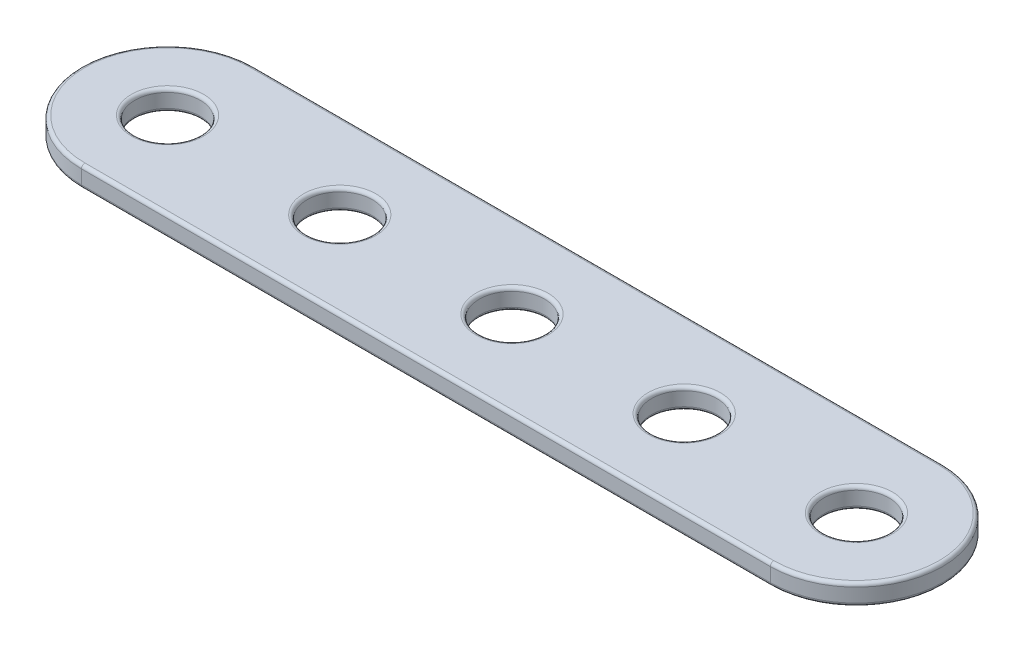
ISO-10303-21;
HEADER;
FILE_DESCRIPTION(('STEP AP214'),'2;1');
FILE_NAME('part.step','',(''),(''),'','','');
FILE_SCHEMA(('AUTOMOTIVE_DESIGN { 1 0 10303 214 1 1 1 1 }'));
ENDSEC;
DATA;
#1=APPLICATION_CONTEXT('core data for automotive mechanical design processes');
#2=APPLICATION_PROTOCOL_DEFINITION('international standard','automotive_design',2000,#1);
#3=PRODUCT_CONTEXT('',#1,'mechanical');
#4=PRODUCT('Part','Part','',(#3));
#5=PRODUCT_RELATED_PRODUCT_CATEGORY('part','',(#4));
#6=PRODUCT_DEFINITION_FORMATION('','',#4);
#7=PRODUCT_DEFINITION_CONTEXT('part definition',#1,'design');
#8=PRODUCT_DEFINITION('design','',#6,#7);
#9=PRODUCT_DEFINITION_SHAPE('','',#8);
#10=(LENGTH_UNIT() NAMED_UNIT(*) SI_UNIT(.MILLI.,.METRE.));
#11=(NAMED_UNIT(*) PLANE_ANGLE_UNIT() SI_UNIT($,.RADIAN.));
#12=(NAMED_UNIT(*) SI_UNIT($,.STERADIAN.) SOLID_ANGLE_UNIT());
#13=UNCERTAINTY_MEASURE_WITH_UNIT(LENGTH_MEASURE(1.E-05),#10,'distance_accuracy_value','');
#14=(GEOMETRIC_REPRESENTATION_CONTEXT(3) GLOBAL_UNCERTAINTY_ASSIGNED_CONTEXT((#13)) GLOBAL_UNIT_ASSIGNED_CONTEXT((#10,
#11,#12)) REPRESENTATION_CONTEXT('',''));
#15=CARTESIAN_POINT('',(0.,0.,0.));
#16=DIRECTION('',(0.,0.,1.));
#17=DIRECTION('',(1.,0.,0.));
#18=AXIS2_PLACEMENT_3D('',#15,#16,#17);
#19=CARTESIAN_POINT('',(0.,1.524,-6.35));
#20=DIRECTION('',(0.,-1.,0.));
#21=DIRECTION('',(0.,0.,-1.));
#22=AXIS2_PLACEMENT_3D('',#19,#20,#21);
#23=CYLINDRICAL_SURFACE('',#22,6.35);
#24=DIRECTION('',(0.,-1.,0.));
#25=VECTOR('',#24,1.);
#26=CARTESIAN_POINT('',(0.,1.524,-12.7));
#27=LINE('',#26,#25);
#28=CARTESIAN_POINT('',(0.,1.27,-12.7));
#29=VERTEX_POINT('',#28);
#30=CARTESIAN_POINT('',(0.,0.254000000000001,-12.7));
#31=VERTEX_POINT('',#30);
#32=EDGE_CURVE('E136',#29,#31,#27,.T.);
#33=ORIENTED_EDGE('',*,*,#32,.T.);
#34=CARTESIAN_POINT('',(0.,0.254,-6.35));
#35=DIRECTION('',(0.,1.,0.));
#36=DIRECTION('',(0.,0.,1.));
#37=AXIS2_PLACEMENT_3D('',#34,#35,#36);
#38=CIRCLE('',#37,6.35);
#39=CARTESIAN_POINT('',(0.,0.254000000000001,0.));
#40=VERTEX_POINT('',#39);
#41=EDGE_CURVE('E172',#31,#40,#38,.T.);
#42=ORIENTED_EDGE('',*,*,#41,.T.);
#43=DIRECTION('',(0.,-1.,0.));
#44=VECTOR('',#43,1.);
#45=CARTESIAN_POINT('',(0.,1.524,0.));
#46=LINE('',#45,#44);
#47=CARTESIAN_POINT('',(0.,1.27,0.));
#48=VERTEX_POINT('',#47);
#49=EDGE_CURVE('E110',#48,#40,#46,.T.);
#50=ORIENTED_EDGE('',*,*,#49,.F.);
#51=CARTESIAN_POINT('',(0.,1.27,-6.35));
#52=DIRECTION('',(0.,1.,0.));
#53=DIRECTION('',(0.,0.,1.));
#54=AXIS2_PLACEMENT_3D('',#51,#52,#53);
#55=CIRCLE('',#54,6.35);
#56=EDGE_CURVE('E170',#48,#29,#55,.F.);
#57=ORIENTED_EDGE('',*,*,#56,.T.);
#58=EDGE_LOOP('',(#33,#42,#50,#57));
#59=FACE_BOUND('',#58,.T.);
#60=ADVANCED_FACE('F26',(#59),#23,.T.);
#61=CARTESIAN_POINT('',(0.,1.524,0.));
#62=DIRECTION('',(0.,0.,-1.));
#63=DIRECTION('',(-1.,0.,0.));
#64=AXIS2_PLACEMENT_3D('',#61,#62,#63);
#65=PLANE('',#64);
#66=ORIENTED_EDGE('',*,*,#49,.T.);
#67=DIRECTION('',(1.,0.,0.));
#68=VECTOR('',#67,1.);
#69=CARTESIAN_POINT('',(0.,0.254,0.));
#70=LINE('',#69,#68);
#71=CARTESIAN_POINT('',(50.8,0.254000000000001,0.));
#72=VERTEX_POINT('',#71);
#73=EDGE_CURVE('E109',#40,#72,#70,.T.);
#74=ORIENTED_EDGE('',*,*,#73,.T.);
#75=DIRECTION('',(0.,-1.,0.));
#76=VECTOR('',#75,1.);
#77=CARTESIAN_POINT('',(50.8,1.524,0.));
#78=LINE('',#77,#76);
#79=CARTESIAN_POINT('',(50.8,1.27,0.));
#80=VERTEX_POINT('',#79);
#81=EDGE_CURVE('E92',#80,#72,#78,.T.);
#82=ORIENTED_EDGE('',*,*,#81,.F.);
#83=DIRECTION('',(1.,0.,0.));
#84=VECTOR('',#83,1.);
#85=CARTESIAN_POINT('',(0.,1.27,0.));
#86=LINE('',#85,#84);
#87=EDGE_CURVE('E106',#80,#48,#86,.F.);
#88=ORIENTED_EDGE('',*,*,#87,.T.);
#89=EDGE_LOOP('',(#66,#74,#82,#88));
#90=FACE_BOUND('',#89,.T.);
#91=ADVANCED_FACE('F105',(#90),#65,.F.);
#92=CARTESIAN_POINT('',(50.8,1.524,-6.35));
#93=DIRECTION('',(0.,-1.,0.));
#94=DIRECTION('',(0.,0.,-1.));
#95=AXIS2_PLACEMENT_3D('',#92,#93,#94);
#96=CYLINDRICAL_SURFACE('',#95,6.35);
#97=ORIENTED_EDGE('',*,*,#81,.T.);
#98=CARTESIAN_POINT('',(50.8,0.254,-6.35));
#99=DIRECTION('',(0.,1.,0.));
#100=DIRECTION('',(0.,0.,1.));
#101=AXIS2_PLACEMENT_3D('',#98,#99,#100);
#102=CIRCLE('',#101,6.35);
#103=CARTESIAN_POINT('',(50.8,0.254000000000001,-12.7));
#104=VERTEX_POINT('',#103);
#105=EDGE_CURVE('E98',#72,#104,#102,.T.);
#106=ORIENTED_EDGE('',*,*,#105,.T.);
#107=DIRECTION('',(0.,-1.,0.));
#108=VECTOR('',#107,1.);
#109=CARTESIAN_POINT('',(50.8,1.524,-12.7));
#110=LINE('',#109,#108);
#111=CARTESIAN_POINT('',(50.8,1.27,-12.7));
#112=VERTEX_POINT('',#111);
#113=EDGE_CURVE('E94',#112,#104,#110,.T.);
#114=ORIENTED_EDGE('',*,*,#113,.F.);
#115=CARTESIAN_POINT('',(50.8,1.27,-6.35));
#116=DIRECTION('',(0.,1.,0.));
#117=DIRECTION('',(0.,0.,1.));
#118=AXIS2_PLACEMENT_3D('',#115,#116,#117);
#119=CIRCLE('',#118,6.35);
#120=EDGE_CURVE('E89',#112,#80,#119,.F.);
#121=ORIENTED_EDGE('',*,*,#120,.T.);
#122=EDGE_LOOP('',(#97,#106,#114,#121));
#123=FACE_BOUND('',#122,.T.);
#124=ADVANCED_FACE('F91',(#123),#96,.T.);
#125=CARTESIAN_POINT('',(0.,1.524,-12.7));
#126=DIRECTION('',(0.,0.,1.));
#127=DIRECTION('',(1.,0.,0.));
#128=AXIS2_PLACEMENT_3D('',#125,#126,#127);
#129=PLANE('',#128);
#130=ORIENTED_EDGE('',*,*,#113,.T.);
#131=DIRECTION('',(-1.,0.,0.));
#132=VECTOR('',#131,1.);
#133=CARTESIAN_POINT('',(0.,0.254,-12.7));
#134=LINE('',#133,#132);
#135=EDGE_CURVE('E168',#104,#31,#134,.T.);
#136=ORIENTED_EDGE('',*,*,#135,.T.);
#137=ORIENTED_EDGE('',*,*,#32,.F.);
#138=DIRECTION('',(-1.,0.,0.));
#139=VECTOR('',#138,1.);
#140=CARTESIAN_POINT('',(50.8,1.27,-12.7));
#141=LINE('',#140,#139);
#142=EDGE_CURVE('E166',#29,#112,#141,.F.);
#143=ORIENTED_EDGE('',*,*,#142,.T.);
#144=EDGE_LOOP('',(#130,#136,#137,#143));
#145=FACE_BOUND('',#144,.T.);
#146=ADVANCED_FACE('F234',(#145),#129,.F.);
#147=CARTESIAN_POINT('',(0.,1.524,-6.35));
#148=DIRECTION('',(0.,1.,0.));
#149=DIRECTION('',(0.,0.,1.));
#150=AXIS2_PLACEMENT_3D('',#147,#148,#149);
#151=PLANE('',#150);
#152=CARTESIAN_POINT('',(50.8,1.524,-6.35));
#153=DIRECTION('',(0.,1.,0.));
#154=DIRECTION('',(0.,0.,1.));
#155=AXIS2_PLACEMENT_3D('',#152,#153,#154);
#156=CIRCLE('',#155,6.096);
#157=CARTESIAN_POINT('',(50.8,1.524,-0.254));
#158=VERTEX_POINT('',#157);
#159=CARTESIAN_POINT('',(50.8,1.524,-12.446));
#160=VERTEX_POINT('',#159);
#161=EDGE_CURVE('E33',#158,#160,#156,.T.);
#162=ORIENTED_EDGE('',*,*,#161,.T.);
#163=DIRECTION('',(-1.,0.,0.));
#164=VECTOR('',#163,1.);
#165=CARTESIAN_POINT('',(0.,1.524,-12.446));
#166=LINE('',#165,#164);
#167=CARTESIAN_POINT('',(0.,1.524,-12.446));
#168=VERTEX_POINT('',#167);
#169=EDGE_CURVE('E11',#160,#168,#166,.T.);
#170=ORIENTED_EDGE('',*,*,#169,.T.);
#171=CARTESIAN_POINT('',(0.,1.524,-6.35));
#172=DIRECTION('',(0.,1.,0.));
#173=DIRECTION('',(0.,0.,1.));
#174=AXIS2_PLACEMENT_3D('',#171,#172,#173);
#175=CIRCLE('',#174,6.096);
#176=CARTESIAN_POINT('',(0.,1.524,-0.254));
#177=VERTEX_POINT('',#176);
#178=EDGE_CURVE('E219',#168,#177,#175,.T.);
#179=ORIENTED_EDGE('',*,*,#178,.T.);
#180=DIRECTION('',(1.,0.,0.));
#181=VECTOR('',#180,1.);
#182=CARTESIAN_POINT('',(50.8,1.524,-0.254));
#183=LINE('',#182,#181);
#184=EDGE_CURVE('E43',#177,#158,#183,.T.);
#185=ORIENTED_EDGE('',*,*,#184,.T.);
#186=EDGE_LOOP('',(#162,#170,#179,#185));
#187=FACE_BOUND('',#186,.T.);
#188=CARTESIAN_POINT('',(0.,1.524,-6.35));
#189=DIRECTION('',(0.,1.,0.));
#190=DIRECTION('',(0.,0.,1.));
#191=AXIS2_PLACEMENT_3D('',#188,#189,#190);
#192=CIRCLE('',#191,2.667);
#193=CARTESIAN_POINT('',(0.,1.524,-3.683));
#194=VERTEX_POINT('',#193);
#195=EDGE_CURVE('E216',#194,#194,#192,.F.);
#196=ORIENTED_EDGE('',*,*,#195,.T.);
#197=EDGE_LOOP('',(#196));
#198=FACE_BOUND('',#197,.T.);
#199=CARTESIAN_POINT('',(12.7,1.524,-6.35));
#200=DIRECTION('',(0.,1.,0.));
#201=DIRECTION('',(0.,0.,1.));
#202=AXIS2_PLACEMENT_3D('',#199,#200,#201);
#203=CIRCLE('',#202,2.667);
#204=CARTESIAN_POINT('',(12.7,1.524,-3.683));
#205=VERTEX_POINT('',#204);
#206=EDGE_CURVE('E213',#205,#205,#203,.F.);
#207=ORIENTED_EDGE('',*,*,#206,.T.);
#208=EDGE_LOOP('',(#207));
#209=FACE_BOUND('',#208,.T.);
#210=CARTESIAN_POINT('',(25.4,1.524,-6.35));
#211=DIRECTION('',(0.,1.,0.));
#212=DIRECTION('',(0.,0.,1.));
#213=AXIS2_PLACEMENT_3D('',#210,#211,#212);
#214=CIRCLE('',#213,2.667);
#215=CARTESIAN_POINT('',(25.4,1.524,-3.683));
#216=VERTEX_POINT('',#215);
#217=EDGE_CURVE('E210',#216,#216,#214,.F.);
#218=ORIENTED_EDGE('',*,*,#217,.T.);
#219=EDGE_LOOP('',(#218));
#220=FACE_BOUND('',#219,.T.);
#221=CARTESIAN_POINT('',(38.1,1.524,-6.35));
#222=DIRECTION('',(0.,1.,0.));
#223=DIRECTION('',(0.,0.,1.));
#224=AXIS2_PLACEMENT_3D('',#221,#222,#223);
#225=CIRCLE('',#224,2.667);
#226=CARTESIAN_POINT('',(38.1,1.524,-3.683));
#227=VERTEX_POINT('',#226);
#228=EDGE_CURVE('E207',#227,#227,#225,.F.);
#229=ORIENTED_EDGE('',*,*,#228,.T.);
#230=EDGE_LOOP('',(#229));
#231=FACE_BOUND('',#230,.T.);
#232=CARTESIAN_POINT('',(50.8,1.524,-6.35));
#233=DIRECTION('',(0.,1.,0.));
#234=DIRECTION('',(0.,0.,1.));
#235=AXIS2_PLACEMENT_3D('',#232,#233,#234);
#236=CIRCLE('',#235,2.667);
#237=CARTESIAN_POINT('',(50.8,1.524,-3.683));
#238=VERTEX_POINT('',#237);
#239=EDGE_CURVE('E204',#238,#238,#236,.F.);
#240=ORIENTED_EDGE('',*,*,#239,.T.);
#241=EDGE_LOOP('',(#240));
#242=FACE_BOUND('',#241,.T.);
#243=ADVANCED_FACE('F222',(#187,#198,#209,#220,#231,#242),#151,.T.);
#244=CARTESIAN_POINT('',(0.,0.,-6.35));
#245=DIRECTION('',(0.,1.,0.));
#246=DIRECTION('',(0.,0.,1.));
#247=AXIS2_PLACEMENT_3D('',#244,#245,#246);
#248=PLANE('',#247);
#249=CARTESIAN_POINT('',(50.8,0.,-6.35));
#250=DIRECTION('',(0.,1.,0.));
#251=DIRECTION('',(0.,0.,1.));
#252=AXIS2_PLACEMENT_3D('',#249,#250,#251);
#253=CIRCLE('',#252,6.096);
#254=CARTESIAN_POINT('',(50.8,0.,-12.446));
#255=VERTEX_POINT('',#254);
#256=CARTESIAN_POINT('',(50.8,0.,-0.254));
#257=VERTEX_POINT('',#256);
#258=EDGE_CURVE('E161',#255,#257,#253,.F.);
#259=ORIENTED_EDGE('',*,*,#258,.T.);
#260=DIRECTION('',(1.,0.,0.));
#261=VECTOR('',#260,1.);
#262=CARTESIAN_POINT('',(0.,0.,-0.254));
#263=LINE('',#262,#261);
#264=CARTESIAN_POINT('',(0.,0.,-0.254));
#265=VERTEX_POINT('',#264);
#266=EDGE_CURVE('E99',#257,#265,#263,.F.);
#267=ORIENTED_EDGE('',*,*,#266,.T.);
#268=CARTESIAN_POINT('',(0.,0.,-6.35));
#269=DIRECTION('',(0.,1.,0.));
#270=DIRECTION('',(0.,0.,1.));
#271=AXIS2_PLACEMENT_3D('',#268,#269,#270);
#272=CIRCLE('',#271,6.096);
#273=CARTESIAN_POINT('',(0.,0.,-12.446));
#274=VERTEX_POINT('',#273);
#275=EDGE_CURVE('E157',#265,#274,#272,.F.);
#276=ORIENTED_EDGE('',*,*,#275,.T.);
#277=DIRECTION('',(-1.,0.,0.));
#278=VECTOR('',#277,1.);
#279=CARTESIAN_POINT('',(0.,0.,-12.446));
#280=LINE('',#279,#278);
#281=EDGE_CURVE('E159',#274,#255,#280,.F.);
#282=ORIENTED_EDGE('',*,*,#281,.T.);
#283=EDGE_LOOP('',(#259,#267,#276,#282));
#284=FACE_BOUND('',#283,.T.);
#285=CARTESIAN_POINT('',(0.,0.,-6.35));
#286=DIRECTION('',(0.,1.,0.));
#287=DIRECTION('',(0.,0.,1.));
#288=AXIS2_PLACEMENT_3D('',#285,#286,#287);
#289=CIRCLE('',#288,2.667);
#290=CARTESIAN_POINT('',(0.,0.,-3.683));
#291=VERTEX_POINT('',#290);
#292=EDGE_CURVE('E154',#291,#291,#289,.T.);
#293=ORIENTED_EDGE('',*,*,#292,.T.);
#294=EDGE_LOOP('',(#293));
#295=FACE_BOUND('',#294,.T.);
#296=CARTESIAN_POINT('',(12.7,0.,-6.35));
#297=DIRECTION('',(0.,1.,0.));
#298=DIRECTION('',(0.,0.,1.));
#299=AXIS2_PLACEMENT_3D('',#296,#297,#298);
#300=CIRCLE('',#299,2.667);
#301=CARTESIAN_POINT('',(12.7,0.,-3.683));
#302=VERTEX_POINT('',#301);
#303=EDGE_CURVE('E151',#302,#302,#300,.T.);
#304=ORIENTED_EDGE('',*,*,#303,.T.);
#305=EDGE_LOOP('',(#304));
#306=FACE_BOUND('',#305,.T.);
#307=CARTESIAN_POINT('',(25.4,0.,-6.35));
#308=DIRECTION('',(0.,1.,0.));
#309=DIRECTION('',(0.,0.,1.));
#310=AXIS2_PLACEMENT_3D('',#307,#308,#309);
#311=CIRCLE('',#310,2.667);
#312=CARTESIAN_POINT('',(25.4,0.,-3.683));
#313=VERTEX_POINT('',#312);
#314=EDGE_CURVE('E148',#313,#313,#311,.T.);
#315=ORIENTED_EDGE('',*,*,#314,.T.);
#316=EDGE_LOOP('',(#315));
#317=FACE_BOUND('',#316,.T.);
#318=CARTESIAN_POINT('',(38.1,0.,-6.35));
#319=DIRECTION('',(0.,1.,0.));
#320=DIRECTION('',(0.,0.,1.));
#321=AXIS2_PLACEMENT_3D('',#318,#319,#320);
#322=CIRCLE('',#321,2.667);
#323=CARTESIAN_POINT('',(38.1,0.,-3.683));
#324=VERTEX_POINT('',#323);
#325=EDGE_CURVE('E145',#324,#324,#322,.T.);
#326=ORIENTED_EDGE('',*,*,#325,.T.);
#327=EDGE_LOOP('',(#326));
#328=FACE_BOUND('',#327,.T.);
#329=CARTESIAN_POINT('',(50.8,0.,-6.35));
#330=DIRECTION('',(0.,1.,0.));
#331=DIRECTION('',(0.,0.,1.));
#332=AXIS2_PLACEMENT_3D('',#329,#330,#331);
#333=CIRCLE('',#332,2.667);
#334=CARTESIAN_POINT('',(50.8,0.,-3.683));
#335=VERTEX_POINT('',#334);
#336=EDGE_CURVE('E142',#335,#335,#333,.T.);
#337=ORIENTED_EDGE('',*,*,#336,.T.);
#338=EDGE_LOOP('',(#337));
#339=FACE_BOUND('',#338,.T.);
#340=ADVANCED_FACE('F263',(#284,#295,#306,#317,#328,#339),#248,.F.);
#341=CARTESIAN_POINT('',(0.,0.,-6.35));
#342=DIRECTION('',(0.,1.,0.));
#343=DIRECTION('',(0.,0.,1.));
#344=AXIS2_PLACEMENT_3D('',#341,#342,#343);
#345=CYLINDRICAL_SURFACE('',#344,2.413);
#346=CARTESIAN_POINT('',(0.,0.254,-6.35));
#347=DIRECTION('',(0.,1.,0.));
#348=DIRECTION('',(0.,0.,1.));
#349=AXIS2_PLACEMENT_3D('',#346,#347,#348);
#350=CIRCLE('',#349,2.413);
#351=CARTESIAN_POINT('',(0.,0.254,-3.937));
#352=VERTEX_POINT('',#351);
#353=EDGE_CURVE('E177',#352,#352,#350,.F.);
#354=CARTESIAN_POINT('',(0.,1.27,-6.35));
#355=DIRECTION('',(0.,1.,0.));
#356=DIRECTION('',(0.,0.,1.));
#357=AXIS2_PLACEMENT_3D('',#354,#355,#356);
#358=CIRCLE('',#357,2.413);
#359=CARTESIAN_POINT('',(0.,1.27,-3.937));
#360=VERTEX_POINT('',#359);
#361=EDGE_CURVE('E174',#360,#360,#358,.T.);
#362=CARTESIAN_POINT('',(0.,0.254,-3.937));
#363=CARTESIAN_POINT('',(0.,0.264583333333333,-3.937));
#364=CARTESIAN_POINT('',(0.,0.275166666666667,-3.937));
#365=CARTESIAN_POINT('',(0.,0.296333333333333,-3.937));
#366=CARTESIAN_POINT('',(0.,0.306916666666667,-3.937));
#367=CARTESIAN_POINT('',(0.,0.328083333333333,-3.937));
#368=CARTESIAN_POINT('',(0.,0.338666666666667,-3.937));
#369=CARTESIAN_POINT('',(0.,0.359833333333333,-3.937));
#370=CARTESIAN_POINT('',(0.,0.370416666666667,-3.937));
#371=CARTESIAN_POINT('',(0.,0.391583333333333,-3.937));
#372=CARTESIAN_POINT('',(0.,0.402166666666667,-3.937));
#373=CARTESIAN_POINT('',(0.,0.423333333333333,-3.937));
#374=CARTESIAN_POINT('',(0.,0.433916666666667,-3.937));
#375=CARTESIAN_POINT('',(0.,0.455083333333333,-3.937));
#376=CARTESIAN_POINT('',(0.,0.465666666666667,-3.937));
#377=CARTESIAN_POINT('',(0.,0.486833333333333,-3.937));
#378=CARTESIAN_POINT('',(0.,0.497416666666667,-3.937));
#379=CARTESIAN_POINT('',(0.,0.518583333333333,-3.937));
#380=CARTESIAN_POINT('',(0.,0.529166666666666,-3.937));
#381=CARTESIAN_POINT('',(0.,0.550333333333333,-3.937));
#382=CARTESIAN_POINT('',(0.,0.560916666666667,-3.937));
#383=CARTESIAN_POINT('',(0.,0.582083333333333,-3.937));
#384=CARTESIAN_POINT('',(0.,0.592666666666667,-3.937));
#385=CARTESIAN_POINT('',(0.,0.613833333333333,-3.937));
#386=CARTESIAN_POINT('',(0.,0.624416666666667,-3.937));
#387=CARTESIAN_POINT('',(0.,0.645583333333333,-3.937));
#388=CARTESIAN_POINT('',(0.,0.656166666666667,-3.937));
#389=CARTESIAN_POINT('',(0.,0.677333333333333,-3.937));
#390=CARTESIAN_POINT('',(0.,0.687916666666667,-3.937));
#391=CARTESIAN_POINT('',(0.,0.709083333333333,-3.937));
#392=CARTESIAN_POINT('',(0.,0.719666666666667,-3.937));
#393=CARTESIAN_POINT('',(0.,0.740833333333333,-3.937));
#394=CARTESIAN_POINT('',(0.,0.751416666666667,-3.937));
#395=CARTESIAN_POINT('',(0.,0.772583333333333,-3.937));
#396=CARTESIAN_POINT('',(0.,0.783166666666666,-3.937));
#397=CARTESIAN_POINT('',(0.,0.804333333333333,-3.937));
#398=CARTESIAN_POINT('',(0.,0.814916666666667,-3.937));
#399=CARTESIAN_POINT('',(0.,0.836083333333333,-3.937));
#400=CARTESIAN_POINT('',(0.,0.846666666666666,-3.937));
#401=CARTESIAN_POINT('',(0.,0.867833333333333,-3.937));
#402=CARTESIAN_POINT('',(0.,0.878416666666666,-3.937));
#403=CARTESIAN_POINT('',(0.,0.899583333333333,-3.937));
#404=CARTESIAN_POINT('',(0.,0.910166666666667,-3.937));
#405=CARTESIAN_POINT('',(0.,0.931333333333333,-3.937));
#406=CARTESIAN_POINT('',(0.,0.941916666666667,-3.937));
#407=CARTESIAN_POINT('',(0.,0.963083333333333,-3.937));
#408=CARTESIAN_POINT('',(0.,0.973666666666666,-3.937));
#409=CARTESIAN_POINT('',(0.,0.994833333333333,-3.937));
#410=CARTESIAN_POINT('',(0.,1.00541666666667,-3.937));
#411=CARTESIAN_POINT('',(0.,1.02658333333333,-3.937));
#412=CARTESIAN_POINT('',(0.,1.03716666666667,-3.937));
#413=CARTESIAN_POINT('',(0.,1.05833333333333,-3.937));
#414=CARTESIAN_POINT('',(0.,1.06891666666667,-3.937));
#415=CARTESIAN_POINT('',(0.,1.09008333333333,-3.937));
#416=CARTESIAN_POINT('',(0.,1.10066666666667,-3.937));
#417=CARTESIAN_POINT('',(0.,1.12183333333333,-3.937));
#418=CARTESIAN_POINT('',(0.,1.13241666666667,-3.937));
#419=CARTESIAN_POINT('',(0.,1.15358333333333,-3.937));
#420=CARTESIAN_POINT('',(0.,1.16416666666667,-3.937));
#421=CARTESIAN_POINT('',(0.,1.18533333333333,-3.937));
#422=CARTESIAN_POINT('',(0.,1.19591666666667,-3.937));
#423=CARTESIAN_POINT('',(0.,1.21708333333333,-3.937));
#424=CARTESIAN_POINT('',(0.,1.22766666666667,-3.937));
#425=CARTESIAN_POINT('',(0.,1.24883333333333,-3.937));
#426=CARTESIAN_POINT('',(0.,1.25941666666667,-3.937));
#427=CARTESIAN_POINT('',(0.,1.27,-3.937));
#428=B_SPLINE_CURVE_WITH_KNOTS('',3,(#362,#363,#364,#365,#366,#367,#368,#369,#370,#371,#372,
#373,#374,#375,#376,#377,#378,#379,#380,#381,#382,#383,#384,#385,#386,#387,#388,#389,#390,#391,
#392,#393,#394,#395,#396,#397,#398,#399,#400,#401,#402,#403,#404,#405,#406,#407,#408,#409,#410,
#411,#412,#413,#414,#415,#416,#417,#418,#419,#420,#421,#422,#423,#424,#425,#426,#427),
.UNSPECIFIED.,.F.,.F.,(4,2,2,2,2,2,2,2,2,2,2,2,2,2,2,2,2,2,2,2,2,2,2,2,2,2,2,2,2,2,2,2,4),(0.,
0.03175,0.0635,0.09525,0.127,0.15875,0.1905,0.22225,0.254,0.28575,0.3175,0.34925,0.381,0.41275,
0.4445,0.47625,0.508,0.53975,0.5715,0.60325,0.635,0.66675,0.6985,0.73025,0.762,0.79375,0.8255,
0.85725,0.889,0.92075,0.9525,0.98425,1.016),.UNSPECIFIED.);
#429=EDGE_CURVE('BSEAM266',#352,#360,#428,.T.);
#430=ORIENTED_EDGE('',*,*,#353,.T.);
#431=ORIENTED_EDGE('',*,*,#361,.T.);
#432=ORIENTED_EDGE('',*,*,#429,.T.);
#433=ORIENTED_EDGE('',*,*,#429,.F.);
#434=EDGE_LOOP('',(#430,#432,#431,#433));
#435=FACE_BOUND('',#434,.T.);
#436=ADVANCED_FACE('F266',(#435),#345,.F.);
#437=CARTESIAN_POINT('',(12.7,0.,-6.35));
#438=DIRECTION('',(0.,1.,0.));
#439=DIRECTION('',(0.,0.,1.));
#440=AXIS2_PLACEMENT_3D('',#437,#438,#439);
#441=CYLINDRICAL_SURFACE('',#440,2.413);
#442=CARTESIAN_POINT('',(12.7,0.254,-6.35));
#443=DIRECTION('',(0.,1.,0.));
#444=DIRECTION('',(0.,0.,1.));
#445=AXIS2_PLACEMENT_3D('',#442,#443,#444);
#446=CIRCLE('',#445,2.413);
#447=CARTESIAN_POINT('',(12.7,0.254,-3.937));
#448=VERTEX_POINT('',#447);
#449=EDGE_CURVE('E183',#448,#448,#446,.F.);
#450=CARTESIAN_POINT('',(12.7,1.27,-6.35));
#451=DIRECTION('',(0.,1.,0.));
#452=DIRECTION('',(0.,0.,1.));
#453=AXIS2_PLACEMENT_3D('',#450,#451,#452);
#454=CIRCLE('',#453,2.413);
#455=CARTESIAN_POINT('',(12.7,1.27,-3.937));
#456=VERTEX_POINT('',#455);
#457=EDGE_CURVE('E180',#456,#456,#454,.T.);
#458=CARTESIAN_POINT('',(12.7,0.254,-3.937));
#459=CARTESIAN_POINT('',(12.7,0.264583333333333,-3.937));
#460=CARTESIAN_POINT('',(12.7,0.275166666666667,-3.937));
#461=CARTESIAN_POINT('',(12.7,0.296333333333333,-3.937));
#462=CARTESIAN_POINT('',(12.7,0.306916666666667,-3.937));
#463=CARTESIAN_POINT('',(12.7,0.328083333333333,-3.937));
#464=CARTESIAN_POINT('',(12.7,0.338666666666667,-3.937));
#465=CARTESIAN_POINT('',(12.7,0.359833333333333,-3.937));
#466=CARTESIAN_POINT('',(12.7,0.370416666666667,-3.937));
#467=CARTESIAN_POINT('',(12.7,0.391583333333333,-3.937));
#468=CARTESIAN_POINT('',(12.7,0.402166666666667,-3.937));
#469=CARTESIAN_POINT('',(12.7,0.423333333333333,-3.937));
#470=CARTESIAN_POINT('',(12.7,0.433916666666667,-3.937));
#471=CARTESIAN_POINT('',(12.7,0.455083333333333,-3.937));
#472=CARTESIAN_POINT('',(12.7,0.465666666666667,-3.937));
#473=CARTESIAN_POINT('',(12.7,0.486833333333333,-3.937));
#474=CARTESIAN_POINT('',(12.7,0.497416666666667,-3.937));
#475=CARTESIAN_POINT('',(12.7,0.518583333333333,-3.937));
#476=CARTESIAN_POINT('',(12.7,0.529166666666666,-3.937));
#477=CARTESIAN_POINT('',(12.7,0.550333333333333,-3.937));
#478=CARTESIAN_POINT('',(12.7,0.560916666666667,-3.937));
#479=CARTESIAN_POINT('',(12.7,0.582083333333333,-3.937));
#480=CARTESIAN_POINT('',(12.7,0.592666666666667,-3.937));
#481=CARTESIAN_POINT('',(12.7,0.613833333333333,-3.937));
#482=CARTESIAN_POINT('',(12.7,0.624416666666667,-3.937));
#483=CARTESIAN_POINT('',(12.7,0.645583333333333,-3.937));
#484=CARTESIAN_POINT('',(12.7,0.656166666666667,-3.937));
#485=CARTESIAN_POINT('',(12.7,0.677333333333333,-3.937));
#486=CARTESIAN_POINT('',(12.7,0.687916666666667,-3.937));
#487=CARTESIAN_POINT('',(12.7,0.709083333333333,-3.937));
#488=CARTESIAN_POINT('',(12.7,0.719666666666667,-3.937));
#489=CARTESIAN_POINT('',(12.7,0.740833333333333,-3.937));
#490=CARTESIAN_POINT('',(12.7,0.751416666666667,-3.937));
#491=CARTESIAN_POINT('',(12.7,0.772583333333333,-3.937));
#492=CARTESIAN_POINT('',(12.7,0.783166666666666,-3.937));
#493=CARTESIAN_POINT('',(12.7,0.804333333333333,-3.937));
#494=CARTESIAN_POINT('',(12.7,0.814916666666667,-3.937));
#495=CARTESIAN_POINT('',(12.7,0.836083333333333,-3.937));
#496=CARTESIAN_POINT('',(12.7,0.846666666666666,-3.937));
#497=CARTESIAN_POINT('',(12.7,0.867833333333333,-3.937));
#498=CARTESIAN_POINT('',(12.7,0.878416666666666,-3.937));
#499=CARTESIAN_POINT('',(12.7,0.899583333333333,-3.937));
#500=CARTESIAN_POINT('',(12.7,0.910166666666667,-3.937));
#501=CARTESIAN_POINT('',(12.7,0.931333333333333,-3.937));
#502=CARTESIAN_POINT('',(12.7,0.941916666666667,-3.937));
#503=CARTESIAN_POINT('',(12.7,0.963083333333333,-3.937));
#504=CARTESIAN_POINT('',(12.7,0.973666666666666,-3.937));
#505=CARTESIAN_POINT('',(12.7,0.994833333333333,-3.937));
#506=CARTESIAN_POINT('',(12.7,1.00541666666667,-3.937));
#507=CARTESIAN_POINT('',(12.7,1.02658333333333,-3.937));
#508=CARTESIAN_POINT('',(12.7,1.03716666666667,-3.937));
#509=CARTESIAN_POINT('',(12.7,1.05833333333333,-3.937));
#510=CARTESIAN_POINT('',(12.7,1.06891666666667,-3.937));
#511=CARTESIAN_POINT('',(12.7,1.09008333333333,-3.937));
#512=CARTESIAN_POINT('',(12.7,1.10066666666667,-3.937));
#513=CARTESIAN_POINT('',(12.7,1.12183333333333,-3.937));
#514=CARTESIAN_POINT('',(12.7,1.13241666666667,-3.937));
#515=CARTESIAN_POINT('',(12.7,1.15358333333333,-3.937));
#516=CARTESIAN_POINT('',(12.7,1.16416666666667,-3.937));
#517=CARTESIAN_POINT('',(12.7,1.18533333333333,-3.937));
#518=CARTESIAN_POINT('',(12.7,1.19591666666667,-3.937));
#519=CARTESIAN_POINT('',(12.7,1.21708333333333,-3.937));
#520=CARTESIAN_POINT('',(12.7,1.22766666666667,-3.937));
#521=CARTESIAN_POINT('',(12.7,1.24883333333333,-3.937));
#522=CARTESIAN_POINT('',(12.7,1.25941666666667,-3.937));
#523=CARTESIAN_POINT('',(12.7,1.27,-3.937));
#524=B_SPLINE_CURVE_WITH_KNOTS('',3,(#458,#459,#460,#461,#462,#463,#464,#465,#466,#467,#468,
#469,#470,#471,#472,#473,#474,#475,#476,#477,#478,#479,#480,#481,#482,#483,#484,#485,#486,#487,
#488,#489,#490,#491,#492,#493,#494,#495,#496,#497,#498,#499,#500,#501,#502,#503,#504,#505,#506,
#507,#508,#509,#510,#511,#512,#513,#514,#515,#516,#517,#518,#519,#520,#521,#522,#523),
.UNSPECIFIED.,.F.,.F.,(4,2,2,2,2,2,2,2,2,2,2,2,2,2,2,2,2,2,2,2,2,2,2,2,2,2,2,2,2,2,2,2,4),(0.,
0.03175,0.0635,0.09525,0.127,0.15875,0.1905,0.22225,0.254,0.28575,0.3175,0.34925,0.381,0.41275,
0.4445,0.47625,0.508,0.53975,0.5715,0.60325,0.635,0.66675,0.6985,0.73025,0.762,0.79375,0.8255,
0.85725,0.889,0.92075,0.9525,0.98425,1.016),.UNSPECIFIED.);
#525=EDGE_CURVE('BSEAM270',#448,#456,#524,.T.);
#526=ORIENTED_EDGE('',*,*,#449,.T.);
#527=ORIENTED_EDGE('',*,*,#457,.T.);
#528=ORIENTED_EDGE('',*,*,#525,.T.);
#529=ORIENTED_EDGE('',*,*,#525,.F.);
#530=EDGE_LOOP('',(#526,#528,#527,#529));
#531=FACE_BOUND('',#530,.T.);
#532=ADVANCED_FACE('F270',(#531),#441,.F.);
#533=CARTESIAN_POINT('',(25.4,0.,-6.35));
#534=DIRECTION('',(0.,1.,0.));
#535=DIRECTION('',(0.,0.,1.));
#536=AXIS2_PLACEMENT_3D('',#533,#534,#535);
#537=CYLINDRICAL_SURFACE('',#536,2.413);
#538=CARTESIAN_POINT('',(25.4,0.254,-6.35));
#539=DIRECTION('',(0.,1.,0.));
#540=DIRECTION('',(0.,0.,1.));
#541=AXIS2_PLACEMENT_3D('',#538,#539,#540);
#542=CIRCLE('',#541,2.413);
#543=CARTESIAN_POINT('',(25.4,0.254,-3.937));
#544=VERTEX_POINT('',#543);
#545=EDGE_CURVE('E189',#544,#544,#542,.F.);
#546=CARTESIAN_POINT('',(25.4,1.27,-6.35));
#547=DIRECTION('',(0.,1.,0.));
#548=DIRECTION('',(0.,0.,1.));
#549=AXIS2_PLACEMENT_3D('',#546,#547,#548);
#550=CIRCLE('',#549,2.413);
#551=CARTESIAN_POINT('',(25.4,1.27,-3.937));
#552=VERTEX_POINT('',#551);
#553=EDGE_CURVE('E186',#552,#552,#550,.T.);
#554=CARTESIAN_POINT('',(25.4,0.254,-3.937));
#555=CARTESIAN_POINT('',(25.4,0.264583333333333,-3.937));
#556=CARTESIAN_POINT('',(25.4,0.275166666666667,-3.937));
#557=CARTESIAN_POINT('',(25.4,0.296333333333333,-3.937));
#558=CARTESIAN_POINT('',(25.4,0.306916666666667,-3.937));
#559=CARTESIAN_POINT('',(25.4,0.328083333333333,-3.937));
#560=CARTESIAN_POINT('',(25.4,0.338666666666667,-3.937));
#561=CARTESIAN_POINT('',(25.4,0.359833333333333,-3.937));
#562=CARTESIAN_POINT('',(25.4,0.370416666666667,-3.937));
#563=CARTESIAN_POINT('',(25.4,0.391583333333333,-3.937));
#564=CARTESIAN_POINT('',(25.4,0.402166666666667,-3.937));
#565=CARTESIAN_POINT('',(25.4,0.423333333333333,-3.937));
#566=CARTESIAN_POINT('',(25.4,0.433916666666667,-3.937));
#567=CARTESIAN_POINT('',(25.4,0.455083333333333,-3.937));
#568=CARTESIAN_POINT('',(25.4,0.465666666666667,-3.937));
#569=CARTESIAN_POINT('',(25.4,0.486833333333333,-3.937));
#570=CARTESIAN_POINT('',(25.4,0.497416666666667,-3.937));
#571=CARTESIAN_POINT('',(25.4,0.518583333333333,-3.937));
#572=CARTESIAN_POINT('',(25.4,0.529166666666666,-3.937));
#573=CARTESIAN_POINT('',(25.4,0.550333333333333,-3.937));
#574=CARTESIAN_POINT('',(25.4,0.560916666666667,-3.937));
#575=CARTESIAN_POINT('',(25.4,0.582083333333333,-3.937));
#576=CARTESIAN_POINT('',(25.4,0.592666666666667,-3.937));
#577=CARTESIAN_POINT('',(25.4,0.613833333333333,-3.937));
#578=CARTESIAN_POINT('',(25.4,0.624416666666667,-3.937));
#579=CARTESIAN_POINT('',(25.4,0.645583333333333,-3.937));
#580=CARTESIAN_POINT('',(25.4,0.656166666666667,-3.937));
#581=CARTESIAN_POINT('',(25.4,0.677333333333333,-3.937));
#582=CARTESIAN_POINT('',(25.4,0.687916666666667,-3.937));
#583=CARTESIAN_POINT('',(25.4,0.709083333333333,-3.937));
#584=CARTESIAN_POINT('',(25.4,0.719666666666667,-3.937));
#585=CARTESIAN_POINT('',(25.4,0.740833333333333,-3.937));
#586=CARTESIAN_POINT('',(25.4,0.751416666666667,-3.937));
#587=CARTESIAN_POINT('',(25.4,0.772583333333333,-3.937));
#588=CARTESIAN_POINT('',(25.4,0.783166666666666,-3.937));
#589=CARTESIAN_POINT('',(25.4,0.804333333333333,-3.937));
#590=CARTESIAN_POINT('',(25.4,0.814916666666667,-3.937));
#591=CARTESIAN_POINT('',(25.4,0.836083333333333,-3.937));
#592=CARTESIAN_POINT('',(25.4,0.846666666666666,-3.937));
#593=CARTESIAN_POINT('',(25.4,0.867833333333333,-3.937));
#594=CARTESIAN_POINT('',(25.4,0.878416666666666,-3.937));
#595=CARTESIAN_POINT('',(25.4,0.899583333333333,-3.937));
#596=CARTESIAN_POINT('',(25.4,0.910166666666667,-3.937));
#597=CARTESIAN_POINT('',(25.4,0.931333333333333,-3.937));
#598=CARTESIAN_POINT('',(25.4,0.941916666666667,-3.937));
#599=CARTESIAN_POINT('',(25.4,0.963083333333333,-3.937));
#600=CARTESIAN_POINT('',(25.4,0.973666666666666,-3.937));
#601=CARTESIAN_POINT('',(25.4,0.994833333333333,-3.937));
#602=CARTESIAN_POINT('',(25.4,1.00541666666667,-3.937));
#603=CARTESIAN_POINT('',(25.4,1.02658333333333,-3.937));
#604=CARTESIAN_POINT('',(25.4,1.03716666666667,-3.937));
#605=CARTESIAN_POINT('',(25.4,1.05833333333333,-3.937));
#606=CARTESIAN_POINT('',(25.4,1.06891666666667,-3.937));
#607=CARTESIAN_POINT('',(25.4,1.09008333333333,-3.937));
#608=CARTESIAN_POINT('',(25.4,1.10066666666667,-3.937));
#609=CARTESIAN_POINT('',(25.4,1.12183333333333,-3.937));
#610=CARTESIAN_POINT('',(25.4,1.13241666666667,-3.937));
#611=CARTESIAN_POINT('',(25.4,1.15358333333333,-3.937));
#612=CARTESIAN_POINT('',(25.4,1.16416666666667,-3.937));
#613=CARTESIAN_POINT('',(25.4,1.18533333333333,-3.937));
#614=CARTESIAN_POINT('',(25.4,1.19591666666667,-3.937));
#615=CARTESIAN_POINT('',(25.4,1.21708333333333,-3.937));
#616=CARTESIAN_POINT('',(25.4,1.22766666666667,-3.937));
#617=CARTESIAN_POINT('',(25.4,1.24883333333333,-3.937));
#618=CARTESIAN_POINT('',(25.4,1.25941666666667,-3.937));
#619=CARTESIAN_POINT('',(25.4,1.27,-3.937));
#620=B_SPLINE_CURVE_WITH_KNOTS('',3,(#554,#555,#556,#557,#558,#559,#560,#561,#562,#563,#564,
#565,#566,#567,#568,#569,#570,#571,#572,#573,#574,#575,#576,#577,#578,#579,#580,#581,#582,#583,
#584,#585,#586,#587,#588,#589,#590,#591,#592,#593,#594,#595,#596,#597,#598,#599,#600,#601,#602,
#603,#604,#605,#606,#607,#608,#609,#610,#611,#612,#613,#614,#615,#616,#617,#618,#619),
.UNSPECIFIED.,.F.,.F.,(4,2,2,2,2,2,2,2,2,2,2,2,2,2,2,2,2,2,2,2,2,2,2,2,2,2,2,2,2,2,2,2,4),(0.,
0.03175,0.0635,0.09525,0.127,0.15875,0.1905,0.22225,0.254,0.28575,0.3175,0.34925,0.381,0.41275,
0.4445,0.47625,0.508,0.53975,0.5715,0.60325,0.635,0.66675,0.6985,0.73025,0.762,0.79375,0.8255,
0.85725,0.889,0.92075,0.9525,0.98425,1.016),.UNSPECIFIED.);
#621=EDGE_CURVE('BSEAM274',#544,#552,#620,.T.);
#622=ORIENTED_EDGE('',*,*,#545,.T.);
#623=ORIENTED_EDGE('',*,*,#553,.T.);
#624=ORIENTED_EDGE('',*,*,#621,.T.);
#625=ORIENTED_EDGE('',*,*,#621,.F.);
#626=EDGE_LOOP('',(#622,#624,#623,#625));
#627=FACE_BOUND('',#626,.T.);
#628=ADVANCED_FACE('F274',(#627),#537,.F.);
#629=CARTESIAN_POINT('',(38.1,0.,-6.35));
#630=DIRECTION('',(0.,1.,0.));
#631=DIRECTION('',(0.,0.,1.));
#632=AXIS2_PLACEMENT_3D('',#629,#630,#631);
#633=CYLINDRICAL_SURFACE('',#632,2.413);
#634=CARTESIAN_POINT('',(38.1,0.254,-6.35));
#635=DIRECTION('',(0.,1.,0.));
#636=DIRECTION('',(0.,0.,1.));
#637=AXIS2_PLACEMENT_3D('',#634,#635,#636);
#638=CIRCLE('',#637,2.413);
#639=CARTESIAN_POINT('',(38.1,0.254,-3.937));
#640=VERTEX_POINT('',#639);
#641=EDGE_CURVE('E195',#640,#640,#638,.F.);
#642=CARTESIAN_POINT('',(38.1,1.27,-6.35));
#643=DIRECTION('',(0.,1.,0.));
#644=DIRECTION('',(0.,0.,1.));
#645=AXIS2_PLACEMENT_3D('',#642,#643,#644);
#646=CIRCLE('',#645,2.413);
#647=CARTESIAN_POINT('',(38.1,1.27,-3.937));
#648=VERTEX_POINT('',#647);
#649=EDGE_CURVE('E192',#648,#648,#646,.T.);
#650=CARTESIAN_POINT('',(38.1,0.254,-3.937));
#651=CARTESIAN_POINT('',(38.1,0.264583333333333,-3.937));
#652=CARTESIAN_POINT('',(38.1,0.275166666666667,-3.937));
#653=CARTESIAN_POINT('',(38.1,0.296333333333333,-3.937));
#654=CARTESIAN_POINT('',(38.1,0.306916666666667,-3.937));
#655=CARTESIAN_POINT('',(38.1,0.328083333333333,-3.937));
#656=CARTESIAN_POINT('',(38.1,0.338666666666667,-3.937));
#657=CARTESIAN_POINT('',(38.1,0.359833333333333,-3.937));
#658=CARTESIAN_POINT('',(38.1,0.370416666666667,-3.937));
#659=CARTESIAN_POINT('',(38.1,0.391583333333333,-3.937));
#660=CARTESIAN_POINT('',(38.1,0.402166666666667,-3.937));
#661=CARTESIAN_POINT('',(38.1,0.423333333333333,-3.937));
#662=CARTESIAN_POINT('',(38.1,0.433916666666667,-3.937));
#663=CARTESIAN_POINT('',(38.1,0.455083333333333,-3.937));
#664=CARTESIAN_POINT('',(38.1,0.465666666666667,-3.937));
#665=CARTESIAN_POINT('',(38.1,0.486833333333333,-3.937));
#666=CARTESIAN_POINT('',(38.1,0.497416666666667,-3.937));
#667=CARTESIAN_POINT('',(38.1,0.518583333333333,-3.937));
#668=CARTESIAN_POINT('',(38.1,0.529166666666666,-3.937));
#669=CARTESIAN_POINT('',(38.1,0.550333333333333,-3.937));
#670=CARTESIAN_POINT('',(38.1,0.560916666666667,-3.937));
#671=CARTESIAN_POINT('',(38.1,0.582083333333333,-3.937));
#672=CARTESIAN_POINT('',(38.1,0.592666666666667,-3.937));
#673=CARTESIAN_POINT('',(38.1,0.613833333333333,-3.937));
#674=CARTESIAN_POINT('',(38.1,0.624416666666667,-3.937));
#675=CARTESIAN_POINT('',(38.1,0.645583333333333,-3.937));
#676=CARTESIAN_POINT('',(38.1,0.656166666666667,-3.937));
#677=CARTESIAN_POINT('',(38.1,0.677333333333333,-3.937));
#678=CARTESIAN_POINT('',(38.1,0.687916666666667,-3.937));
#679=CARTESIAN_POINT('',(38.1,0.709083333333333,-3.937));
#680=CARTESIAN_POINT('',(38.1,0.719666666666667,-3.937));
#681=CARTESIAN_POINT('',(38.1,0.740833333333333,-3.937));
#682=CARTESIAN_POINT('',(38.1,0.751416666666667,-3.937));
#683=CARTESIAN_POINT('',(38.1,0.772583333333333,-3.937));
#684=CARTESIAN_POINT('',(38.1,0.783166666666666,-3.937));
#685=CARTESIAN_POINT('',(38.1,0.804333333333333,-3.937));
#686=CARTESIAN_POINT('',(38.1,0.814916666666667,-3.937));
#687=CARTESIAN_POINT('',(38.1,0.836083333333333,-3.937));
#688=CARTESIAN_POINT('',(38.1,0.846666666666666,-3.937));
#689=CARTESIAN_POINT('',(38.1,0.867833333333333,-3.937));
#690=CARTESIAN_POINT('',(38.1,0.878416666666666,-3.937));
#691=CARTESIAN_POINT('',(38.1,0.899583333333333,-3.937));
#692=CARTESIAN_POINT('',(38.1,0.910166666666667,-3.937));
#693=CARTESIAN_POINT('',(38.1,0.931333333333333,-3.937));
#694=CARTESIAN_POINT('',(38.1,0.941916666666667,-3.937));
#695=CARTESIAN_POINT('',(38.1,0.963083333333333,-3.937));
#696=CARTESIAN_POINT('',(38.1,0.973666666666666,-3.937));
#697=CARTESIAN_POINT('',(38.1,0.994833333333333,-3.937));
#698=CARTESIAN_POINT('',(38.1,1.00541666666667,-3.937));
#699=CARTESIAN_POINT('',(38.1,1.02658333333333,-3.937));
#700=CARTESIAN_POINT('',(38.1,1.03716666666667,-3.937));
#701=CARTESIAN_POINT('',(38.1,1.05833333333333,-3.937));
#702=CARTESIAN_POINT('',(38.1,1.06891666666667,-3.937));
#703=CARTESIAN_POINT('',(38.1,1.09008333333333,-3.937));
#704=CARTESIAN_POINT('',(38.1,1.10066666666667,-3.937));
#705=CARTESIAN_POINT('',(38.1,1.12183333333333,-3.937));
#706=CARTESIAN_POINT('',(38.1,1.13241666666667,-3.937));
#707=CARTESIAN_POINT('',(38.1,1.15358333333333,-3.937));
#708=CARTESIAN_POINT('',(38.1,1.16416666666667,-3.937));
#709=CARTESIAN_POINT('',(38.1,1.18533333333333,-3.937));
#710=CARTESIAN_POINT('',(38.1,1.19591666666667,-3.937));
#711=CARTESIAN_POINT('',(38.1,1.21708333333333,-3.937));
#712=CARTESIAN_POINT('',(38.1,1.22766666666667,-3.937));
#713=CARTESIAN_POINT('',(38.1,1.24883333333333,-3.937));
#714=CARTESIAN_POINT('',(38.1,1.25941666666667,-3.937));
#715=CARTESIAN_POINT('',(38.1,1.27,-3.937));
#716=B_SPLINE_CURVE_WITH_KNOTS('',3,(#650,#651,#652,#653,#654,#655,#656,#657,#658,#659,#660,
#661,#662,#663,#664,#665,#666,#667,#668,#669,#670,#671,#672,#673,#674,#675,#676,#677,#678,#679,
#680,#681,#682,#683,#684,#685,#686,#687,#688,#689,#690,#691,#692,#693,#694,#695,#696,#697,#698,
#699,#700,#701,#702,#703,#704,#705,#706,#707,#708,#709,#710,#711,#712,#713,#714,#715),
.UNSPECIFIED.,.F.,.F.,(4,2,2,2,2,2,2,2,2,2,2,2,2,2,2,2,2,2,2,2,2,2,2,2,2,2,2,2,2,2,2,2,4),(0.,
0.03175,0.0635,0.09525,0.127,0.15875,0.1905,0.22225,0.254,0.28575,0.3175,0.34925,0.381,0.41275,
0.4445,0.47625,0.508,0.53975,0.5715,0.60325,0.635,0.66675,0.6985,0.73025,0.762,0.79375,0.8255,
0.85725,0.889,0.92075,0.9525,0.98425,1.016),.UNSPECIFIED.);
#717=EDGE_CURVE('BSEAM278',#640,#648,#716,.T.);
#718=ORIENTED_EDGE('',*,*,#641,.T.);
#719=ORIENTED_EDGE('',*,*,#649,.T.);
#720=ORIENTED_EDGE('',*,*,#717,.T.);
#721=ORIENTED_EDGE('',*,*,#717,.F.);
#722=EDGE_LOOP('',(#718,#720,#719,#721));
#723=FACE_BOUND('',#722,.T.);
#724=ADVANCED_FACE('F278',(#723),#633,.F.);
#725=CARTESIAN_POINT('',(50.8,0.,-6.35));
#726=DIRECTION('',(0.,1.,0.));
#727=DIRECTION('',(0.,0.,1.));
#728=AXIS2_PLACEMENT_3D('',#725,#726,#727);
#729=CYLINDRICAL_SURFACE('',#728,2.413);
#730=CARTESIAN_POINT('',(50.8,0.254,-6.35));
#731=DIRECTION('',(0.,1.,0.));
#732=DIRECTION('',(0.,0.,1.));
#733=AXIS2_PLACEMENT_3D('',#730,#731,#732);
#734=CIRCLE('',#733,2.413);
#735=CARTESIAN_POINT('',(50.8,0.254,-3.937));
#736=VERTEX_POINT('',#735);
#737=EDGE_CURVE('E201',#736,#736,#734,.F.);
#738=CARTESIAN_POINT('',(50.8,1.27,-6.35));
#739=DIRECTION('',(0.,1.,0.));
#740=DIRECTION('',(0.,0.,1.));
#741=AXIS2_PLACEMENT_3D('',#738,#739,#740);
#742=CIRCLE('',#741,2.413);
#743=CARTESIAN_POINT('',(50.8,1.27,-3.937));
#744=VERTEX_POINT('',#743);
#745=EDGE_CURVE('E198',#744,#744,#742,.T.);
#746=CARTESIAN_POINT('',(50.8,0.254,-3.937));
#747=CARTESIAN_POINT('',(50.8,0.264583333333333,-3.937));
#748=CARTESIAN_POINT('',(50.8,0.275166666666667,-3.937));
#749=CARTESIAN_POINT('',(50.8,0.296333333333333,-3.937));
#750=CARTESIAN_POINT('',(50.8,0.306916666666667,-3.937));
#751=CARTESIAN_POINT('',(50.8,0.328083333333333,-3.937));
#752=CARTESIAN_POINT('',(50.8,0.338666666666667,-3.937));
#753=CARTESIAN_POINT('',(50.8,0.359833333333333,-3.937));
#754=CARTESIAN_POINT('',(50.8,0.370416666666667,-3.937));
#755=CARTESIAN_POINT('',(50.8,0.391583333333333,-3.937));
#756=CARTESIAN_POINT('',(50.8,0.402166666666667,-3.937));
#757=CARTESIAN_POINT('',(50.8,0.423333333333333,-3.937));
#758=CARTESIAN_POINT('',(50.8,0.433916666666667,-3.937));
#759=CARTESIAN_POINT('',(50.8,0.455083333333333,-3.937));
#760=CARTESIAN_POINT('',(50.8,0.465666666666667,-3.937));
#761=CARTESIAN_POINT('',(50.8,0.486833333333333,-3.937));
#762=CARTESIAN_POINT('',(50.8,0.497416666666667,-3.937));
#763=CARTESIAN_POINT('',(50.8,0.518583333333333,-3.937));
#764=CARTESIAN_POINT('',(50.8,0.529166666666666,-3.937));
#765=CARTESIAN_POINT('',(50.8,0.550333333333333,-3.937));
#766=CARTESIAN_POINT('',(50.8,0.560916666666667,-3.937));
#767=CARTESIAN_POINT('',(50.8,0.582083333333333,-3.937));
#768=CARTESIAN_POINT('',(50.8,0.592666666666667,-3.937));
#769=CARTESIAN_POINT('',(50.8,0.613833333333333,-3.937));
#770=CARTESIAN_POINT('',(50.8,0.624416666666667,-3.937));
#771=CARTESIAN_POINT('',(50.8,0.645583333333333,-3.937));
#772=CARTESIAN_POINT('',(50.8,0.656166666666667,-3.937));
#773=CARTESIAN_POINT('',(50.8,0.677333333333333,-3.937));
#774=CARTESIAN_POINT('',(50.8,0.687916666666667,-3.937));
#775=CARTESIAN_POINT('',(50.8,0.709083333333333,-3.937));
#776=CARTESIAN_POINT('',(50.8,0.719666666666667,-3.937));
#777=CARTESIAN_POINT('',(50.8,0.740833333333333,-3.937));
#778=CARTESIAN_POINT('',(50.8,0.751416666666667,-3.937));
#779=CARTESIAN_POINT('',(50.8,0.772583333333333,-3.937));
#780=CARTESIAN_POINT('',(50.8,0.783166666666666,-3.937));
#781=CARTESIAN_POINT('',(50.8,0.804333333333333,-3.937));
#782=CARTESIAN_POINT('',(50.8,0.814916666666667,-3.937));
#783=CARTESIAN_POINT('',(50.8,0.836083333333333,-3.937));
#784=CARTESIAN_POINT('',(50.8,0.846666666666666,-3.937));
#785=CARTESIAN_POINT('',(50.8,0.867833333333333,-3.937));
#786=CARTESIAN_POINT('',(50.8,0.878416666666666,-3.937));
#787=CARTESIAN_POINT('',(50.8,0.899583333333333,-3.937));
#788=CARTESIAN_POINT('',(50.8,0.910166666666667,-3.937));
#789=CARTESIAN_POINT('',(50.8,0.931333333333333,-3.937));
#790=CARTESIAN_POINT('',(50.8,0.941916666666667,-3.937));
#791=CARTESIAN_POINT('',(50.8,0.963083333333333,-3.937));
#792=CARTESIAN_POINT('',(50.8,0.973666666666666,-3.937));
#793=CARTESIAN_POINT('',(50.8,0.994833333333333,-3.937));
#794=CARTESIAN_POINT('',(50.8,1.00541666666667,-3.937));
#795=CARTESIAN_POINT('',(50.8,1.02658333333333,-3.937));
#796=CARTESIAN_POINT('',(50.8,1.03716666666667,-3.937));
#797=CARTESIAN_POINT('',(50.8,1.05833333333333,-3.937));
#798=CARTESIAN_POINT('',(50.8,1.06891666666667,-3.937));
#799=CARTESIAN_POINT('',(50.8,1.09008333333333,-3.937));
#800=CARTESIAN_POINT('',(50.8,1.10066666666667,-3.937));
#801=CARTESIAN_POINT('',(50.8,1.12183333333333,-3.937));
#802=CARTESIAN_POINT('',(50.8,1.13241666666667,-3.937));
#803=CARTESIAN_POINT('',(50.8,1.15358333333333,-3.937));
#804=CARTESIAN_POINT('',(50.8,1.16416666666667,-3.937));
#805=CARTESIAN_POINT('',(50.8,1.18533333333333,-3.937));
#806=CARTESIAN_POINT('',(50.8,1.19591666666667,-3.937));
#807=CARTESIAN_POINT('',(50.8,1.21708333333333,-3.937));
#808=CARTESIAN_POINT('',(50.8,1.22766666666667,-3.937));
#809=CARTESIAN_POINT('',(50.8,1.24883333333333,-3.937));
#810=CARTESIAN_POINT('',(50.8,1.25941666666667,-3.937));
#811=CARTESIAN_POINT('',(50.8,1.27,-3.937));
#812=B_SPLINE_CURVE_WITH_KNOTS('',3,(#746,#747,#748,#749,#750,#751,#752,#753,#754,#755,#756,
#757,#758,#759,#760,#761,#762,#763,#764,#765,#766,#767,#768,#769,#770,#771,#772,#773,#774,#775,
#776,#777,#778,#779,#780,#781,#782,#783,#784,#785,#786,#787,#788,#789,#790,#791,#792,#793,#794,
#795,#796,#797,#798,#799,#800,#801,#802,#803,#804,#805,#806,#807,#808,#809,#810,#811),
.UNSPECIFIED.,.F.,.F.,(4,2,2,2,2,2,2,2,2,2,2,2,2,2,2,2,2,2,2,2,2,2,2,2,2,2,2,2,2,2,2,2,4),(0.,
0.03175,0.0635,0.09525,0.127,0.15875,0.1905,0.22225,0.254,0.28575,0.3175,0.34925,0.381,0.41275,
0.4445,0.47625,0.508,0.53975,0.5715,0.60325,0.635,0.66675,0.6985,0.73025,0.762,0.79375,0.8255,
0.85725,0.889,0.92075,0.9525,0.98425,1.016),.UNSPECIFIED.);
#813=EDGE_CURVE('BSEAM282',#736,#744,#812,.T.);
#814=ORIENTED_EDGE('',*,*,#737,.T.);
#815=ORIENTED_EDGE('',*,*,#745,.T.);
#816=ORIENTED_EDGE('',*,*,#813,.T.);
#817=ORIENTED_EDGE('',*,*,#813,.F.);
#818=EDGE_LOOP('',(#814,#816,#815,#817));
#819=FACE_BOUND('',#818,.T.);
#820=ADVANCED_FACE('F282',(#819),#729,.F.);
#821=CARTESIAN_POINT('',(0.,0.254,-12.446));
#822=DIRECTION('',(-1.,0.,0.));
#823=DIRECTION('',(0.,0.,1.));
#824=AXIS2_PLACEMENT_3D('',#821,#822,#823);
#825=CYLINDRICAL_SURFACE('',#824,0.254);
#826=CARTESIAN_POINT('',(50.8,0.254,-12.446));
#827=DIRECTION('',(1.,0.,0.));
#828=DIRECTION('',(0.,0.,-1.));
#829=AXIS2_PLACEMENT_3D('',#826,#827,#828);
#830=CIRCLE('',#829,0.254);
#831=EDGE_CURVE('E130',#255,#104,#830,.T.);
#832=ORIENTED_EDGE('',*,*,#831,.F.);
#833=ORIENTED_EDGE('',*,*,#281,.F.);
#834=CARTESIAN_POINT('',(0.,0.254,-12.446));
#835=DIRECTION('',(-1.,0.,0.));
#836=DIRECTION('',(0.,0.,1.));
#837=AXIS2_PLACEMENT_3D('',#834,#835,#836);
#838=CIRCLE('',#837,0.254);
#839=EDGE_CURVE('E133',#31,#274,#838,.T.);
#840=ORIENTED_EDGE('',*,*,#839,.F.);
#841=ORIENTED_EDGE('',*,*,#135,.F.);
#842=EDGE_LOOP('',(#832,#833,#840,#841));
#843=FACE_BOUND('',#842,.T.);
#844=ADVANCED_FACE('F286',(#843),#825,.T.);
#845=CARTESIAN_POINT('',(0.,0.254,-6.35));
#846=DIRECTION('',(0.,1.,0.));
#847=DIRECTION('',(0.,0.,1.));
#848=AXIS2_PLACEMENT_3D('',#845,#846,#847);
#849=TOROIDAL_SURFACE('',#848,6.096,0.254);
#850=ORIENTED_EDGE('',*,*,#839,.T.);
#851=ORIENTED_EDGE('',*,*,#275,.F.);
#852=CARTESIAN_POINT('',(0.,0.254,-0.254));
#853=DIRECTION('',(1.,0.,0.));
#854=DIRECTION('',(0.,0.,-1.));
#855=AXIS2_PLACEMENT_3D('',#852,#853,#854);
#856=CIRCLE('',#855,0.254);
#857=EDGE_CURVE('E123',#40,#265,#856,.T.);
#858=ORIENTED_EDGE('',*,*,#857,.F.);
#859=ORIENTED_EDGE('',*,*,#41,.F.);
#860=EDGE_LOOP('',(#850,#851,#858,#859));
#861=FACE_BOUND('',#860,.T.);
#862=ADVANCED_FACE('F290',(#861),#849,.T.);
#863=CARTESIAN_POINT('',(50.8,0.254,-6.35));
#864=DIRECTION('',(0.,1.,0.));
#865=DIRECTION('',(0.,0.,1.));
#866=AXIS2_PLACEMENT_3D('',#863,#864,#865);
#867=TOROIDAL_SURFACE('',#866,6.096,0.254);
#868=ORIENTED_EDGE('',*,*,#831,.T.);
#869=ORIENTED_EDGE('',*,*,#105,.F.);
#870=CARTESIAN_POINT('',(50.8,0.254,-0.254));
#871=DIRECTION('',(-1.,0.,0.));
#872=DIRECTION('',(0.,0.,1.));
#873=AXIS2_PLACEMENT_3D('',#870,#871,#872);
#874=CIRCLE('',#873,0.254);
#875=EDGE_CURVE('E121',#257,#72,#874,.T.);
#876=ORIENTED_EDGE('',*,*,#875,.F.);
#877=ORIENTED_EDGE('',*,*,#258,.F.);
#878=EDGE_LOOP('',(#868,#869,#876,#877));
#879=FACE_BOUND('',#878,.T.);
#880=ADVANCED_FACE('F294',(#879),#867,.T.);
#881=CARTESIAN_POINT('',(0.,0.254,-0.254));
#882=DIRECTION('',(1.,0.,0.));
#883=DIRECTION('',(0.,0.,-1.));
#884=AXIS2_PLACEMENT_3D('',#881,#882,#883);
#885=CYLINDRICAL_SURFACE('',#884,0.254);
#886=ORIENTED_EDGE('',*,*,#857,.T.);
#887=ORIENTED_EDGE('',*,*,#266,.F.);
#888=ORIENTED_EDGE('',*,*,#875,.T.);
#889=ORIENTED_EDGE('',*,*,#73,.F.);
#890=EDGE_LOOP('',(#886,#887,#888,#889));
#891=FACE_BOUND('',#890,.T.);
#892=ADVANCED_FACE('F298',(#891),#885,.T.);
#893=CARTESIAN_POINT('',(0.,0.254,-6.35));
#894=DIRECTION('',(0.,1.,0.));
#895=DIRECTION('',(0.,0.,1.));
#896=AXIS2_PLACEMENT_3D('',#893,#894,#895);
#897=TOROIDAL_SURFACE('',#896,2.667,0.254);
#898=ORIENTED_EDGE('',*,*,#353,.F.);
#899=EDGE_LOOP('',(#898));
#900=FACE_BOUND('',#899,.T.);
#901=ORIENTED_EDGE('',*,*,#292,.F.);
#902=EDGE_LOOP('',(#901));
#903=FACE_BOUND('',#902,.T.);
#904=ADVANCED_FACE('F302',(#900,#903),#897,.T.);
#905=CARTESIAN_POINT('',(12.7,0.254,-6.35));
#906=DIRECTION('',(0.,1.,0.));
#907=DIRECTION('',(0.,0.,1.));
#908=AXIS2_PLACEMENT_3D('',#905,#906,#907);
#909=TOROIDAL_SURFACE('',#908,2.667,0.254);
#910=ORIENTED_EDGE('',*,*,#449,.F.);
#911=EDGE_LOOP('',(#910));
#912=FACE_BOUND('',#911,.T.);
#913=ORIENTED_EDGE('',*,*,#303,.F.);
#914=EDGE_LOOP('',(#913));
#915=FACE_BOUND('',#914,.T.);
#916=ADVANCED_FACE('F306',(#912,#915),#909,.T.);
#917=CARTESIAN_POINT('',(25.4,0.254,-6.35));
#918=DIRECTION('',(0.,1.,0.));
#919=DIRECTION('',(0.,0.,1.));
#920=AXIS2_PLACEMENT_3D('',#917,#918,#919);
#921=TOROIDAL_SURFACE('',#920,2.667,0.254);
#922=ORIENTED_EDGE('',*,*,#545,.F.);
#923=EDGE_LOOP('',(#922));
#924=FACE_BOUND('',#923,.T.);
#925=ORIENTED_EDGE('',*,*,#314,.F.);
#926=EDGE_LOOP('',(#925));
#927=FACE_BOUND('',#926,.T.);
#928=ADVANCED_FACE('F310',(#924,#927),#921,.T.);
#929=CARTESIAN_POINT('',(38.1,0.254,-6.35));
#930=DIRECTION('',(0.,1.,0.));
#931=DIRECTION('',(0.,0.,1.));
#932=AXIS2_PLACEMENT_3D('',#929,#930,#931);
#933=TOROIDAL_SURFACE('',#932,2.667,0.254);
#934=ORIENTED_EDGE('',*,*,#641,.F.);
#935=EDGE_LOOP('',(#934));
#936=FACE_BOUND('',#935,.T.);
#937=ORIENTED_EDGE('',*,*,#325,.F.);
#938=EDGE_LOOP('',(#937));
#939=FACE_BOUND('',#938,.T.);
#940=ADVANCED_FACE('F314',(#936,#939),#933,.T.);
#941=CARTESIAN_POINT('',(50.8,0.254,-6.35));
#942=DIRECTION('',(0.,1.,0.));
#943=DIRECTION('',(0.,0.,1.));
#944=AXIS2_PLACEMENT_3D('',#941,#942,#943);
#945=TOROIDAL_SURFACE('',#944,2.667,0.254);
#946=ORIENTED_EDGE('',*,*,#737,.F.);
#947=EDGE_LOOP('',(#946));
#948=FACE_BOUND('',#947,.T.);
#949=ORIENTED_EDGE('',*,*,#336,.F.);
#950=EDGE_LOOP('',(#949));
#951=FACE_BOUND('',#950,.T.);
#952=ADVANCED_FACE('F318',(#948,#951),#945,.T.);
#953=CARTESIAN_POINT('',(0.,1.27,-0.254));
#954=DIRECTION('',(-1.,0.,0.));
#955=DIRECTION('',(0.,0.,1.));
#956=AXIS2_PLACEMENT_3D('',#953,#954,#955);
#957=CYLINDRICAL_SURFACE('',#956,0.254);
#958=CARTESIAN_POINT('',(0.,1.27,-0.254));
#959=DIRECTION('',(-1.,0.,0.));
#960=DIRECTION('',(0.,0.,1.));
#961=AXIS2_PLACEMENT_3D('',#958,#959,#960);
#962=CIRCLE('',#961,0.254);
#963=EDGE_CURVE('E117',#48,#177,#962,.T.);
#964=ORIENTED_EDGE('',*,*,#963,.F.);
#965=ORIENTED_EDGE('',*,*,#87,.F.);
#966=CARTESIAN_POINT('',(50.8,1.27,-0.254));
#967=DIRECTION('',(1.,0.,0.));
#968=DIRECTION('',(0.,0.,-1.));
#969=AXIS2_PLACEMENT_3D('',#966,#967,#968);
#970=CIRCLE('',#969,0.254);
#971=EDGE_CURVE('E115',#158,#80,#970,.T.);
#972=ORIENTED_EDGE('',*,*,#971,.F.);
#973=ORIENTED_EDGE('',*,*,#184,.F.);
#974=EDGE_LOOP('',(#964,#965,#972,#973));
#975=FACE_BOUND('',#974,.T.);
#976=ADVANCED_FACE('F114',(#975),#957,.T.);
#977=CARTESIAN_POINT('',(50.8,1.27,-6.35));
#978=DIRECTION('',(0.,1.,0.));
#979=DIRECTION('',(0.,0.,1.));
#980=AXIS2_PLACEMENT_3D('',#977,#978,#979);
#981=TOROIDAL_SURFACE('',#980,6.096,0.254);
#982=ORIENTED_EDGE('',*,*,#971,.T.);
#983=ORIENTED_EDGE('',*,*,#120,.F.);
#984=CARTESIAN_POINT('',(50.8,1.27,-12.446));
#985=DIRECTION('',(-1.,0.,0.));
#986=DIRECTION('',(0.,0.,1.));
#987=AXIS2_PLACEMENT_3D('',#984,#985,#986);
#988=CIRCLE('',#987,0.254);
#989=EDGE_CURVE('E125',#160,#112,#988,.T.);
#990=ORIENTED_EDGE('',*,*,#989,.F.);
#991=ORIENTED_EDGE('',*,*,#161,.F.);
#992=EDGE_LOOP('',(#982,#983,#990,#991));
#993=FACE_BOUND('',#992,.T.);
#994=ADVANCED_FACE('F120',(#993),#981,.T.);
#995=CARTESIAN_POINT('',(0.,1.27,-6.35));
#996=DIRECTION('',(0.,1.,0.));
#997=DIRECTION('',(0.,0.,1.));
#998=AXIS2_PLACEMENT_3D('',#995,#996,#997);
#999=TOROIDAL_SURFACE('',#998,6.096,0.254);
#1000=ORIENTED_EDGE('',*,*,#963,.T.);
#1001=ORIENTED_EDGE('',*,*,#178,.F.);
#1002=CARTESIAN_POINT('',(0.,1.27,-12.446));
#1003=DIRECTION('',(1.,0.,0.));
#1004=DIRECTION('',(0.,0.,-1.));
#1005=AXIS2_PLACEMENT_3D('',#1002,#1003,#1004);
#1006=CIRCLE('',#1005,0.254);
#1007=EDGE_CURVE('E228',#29,#168,#1006,.T.);
#1008=ORIENTED_EDGE('',*,*,#1007,.F.);
#1009=ORIENTED_EDGE('',*,*,#56,.F.);
#1010=EDGE_LOOP('',(#1000,#1001,#1008,#1009));
#1011=FACE_BOUND('',#1010,.T.);
#1012=ADVANCED_FACE('F227',(#1011),#999,.T.);
#1013=CARTESIAN_POINT('',(0.,1.27,-12.446));
#1014=DIRECTION('',(1.,0.,0.));
#1015=DIRECTION('',(0.,0.,-1.));
#1016=AXIS2_PLACEMENT_3D('',#1013,#1014,#1015);
#1017=CYLINDRICAL_SURFACE('',#1016,0.254);
#1018=ORIENTED_EDGE('',*,*,#989,.T.);
#1019=ORIENTED_EDGE('',*,*,#142,.F.);
#1020=ORIENTED_EDGE('',*,*,#1007,.T.);
#1021=ORIENTED_EDGE('',*,*,#169,.F.);
#1022=EDGE_LOOP('',(#1018,#1019,#1020,#1021));
#1023=FACE_BOUND('',#1022,.T.);
#1024=ADVANCED_FACE('F237',(#1023),#1017,.T.);
#1025=CARTESIAN_POINT('',(0.,1.27,-6.35));
#1026=DIRECTION('',(0.,1.,0.));
#1027=DIRECTION('',(0.,0.,1.));
#1028=AXIS2_PLACEMENT_3D('',#1025,#1026,#1027);
#1029=TOROIDAL_SURFACE('',#1028,2.667,0.254);
#1030=ORIENTED_EDGE('',*,*,#195,.F.);
#1031=EDGE_LOOP('',(#1030));
#1032=FACE_BOUND('',#1031,.T.);
#1033=ORIENTED_EDGE('',*,*,#361,.F.);
#1034=EDGE_LOOP('',(#1033));
#1035=FACE_BOUND('',#1034,.T.);
#1036=ADVANCED_FACE('F240',(#1032,#1035),#1029,.T.);
#1037=CARTESIAN_POINT('',(12.7,1.27,-6.35));
#1038=DIRECTION('',(0.,1.,0.));
#1039=DIRECTION('',(0.,0.,1.));
#1040=AXIS2_PLACEMENT_3D('',#1037,#1038,#1039);
#1041=TOROIDAL_SURFACE('',#1040,2.667,0.254);
#1042=ORIENTED_EDGE('',*,*,#206,.F.);
#1043=EDGE_LOOP('',(#1042));
#1044=FACE_BOUND('',#1043,.T.);
#1045=ORIENTED_EDGE('',*,*,#457,.F.);
#1046=EDGE_LOOP('',(#1045));
#1047=FACE_BOUND('',#1046,.T.);
#1048=ADVANCED_FACE('F246',(#1044,#1047),#1041,.T.);
#1049=CARTESIAN_POINT('',(25.4,1.27,-6.35));
#1050=DIRECTION('',(0.,1.,0.));
#1051=DIRECTION('',(0.,0.,1.));
#1052=AXIS2_PLACEMENT_3D('',#1049,#1050,#1051);
#1053=TOROIDAL_SURFACE('',#1052,2.667,0.254);
#1054=ORIENTED_EDGE('',*,*,#217,.F.);
#1055=EDGE_LOOP('',(#1054));
#1056=FACE_BOUND('',#1055,.T.);
#1057=ORIENTED_EDGE('',*,*,#553,.F.);
#1058=EDGE_LOOP('',(#1057));
#1059=FACE_BOUND('',#1058,.T.);
#1060=ADVANCED_FACE('F347',(#1056,#1059),#1053,.T.);
#1061=CARTESIAN_POINT('',(38.1,1.27,-6.35));
#1062=DIRECTION('',(0.,1.,0.));
#1063=DIRECTION('',(0.,0.,1.));
#1064=AXIS2_PLACEMENT_3D('',#1061,#1062,#1063);
#1065=TOROIDAL_SURFACE('',#1064,2.667,0.254);
#1066=ORIENTED_EDGE('',*,*,#228,.F.);
#1067=EDGE_LOOP('',(#1066));
#1068=FACE_BOUND('',#1067,.T.);
#1069=ORIENTED_EDGE('',*,*,#649,.F.);
#1070=EDGE_LOOP('',(#1069));
#1071=FACE_BOUND('',#1070,.T.);
#1072=ADVANCED_FACE('F355',(#1068,#1071),#1065,.T.);
#1073=CARTESIAN_POINT('',(50.8,1.27,-6.35));
#1074=DIRECTION('',(0.,1.,0.));
#1075=DIRECTION('',(0.,0.,1.));
#1076=AXIS2_PLACEMENT_3D('',#1073,#1074,#1075);
#1077=TOROIDAL_SURFACE('',#1076,2.667,0.254);
#1078=ORIENTED_EDGE('',*,*,#239,.F.);
#1079=EDGE_LOOP('',(#1078));
#1080=FACE_BOUND('',#1079,.T.);
#1081=ORIENTED_EDGE('',*,*,#745,.F.);
#1082=EDGE_LOOP('',(#1081));
#1083=FACE_BOUND('',#1082,.T.);
#1084=ADVANCED_FACE('F363',(#1080,#1083),#1077,.T.);
#1085=CLOSED_SHELL('',(#60,#91,#124,#146,#243,#340,#436,#532,#628,#724,#820,#844,#862,#880,#892,
#904,#916,#928,#940,#952,#976,#994,#1012,#1024,#1036,#1048,#1060,#1072,#1084));
#1086=MANIFOLD_SOLID_BREP('B2',#1085);
#1087=ADVANCED_BREP_SHAPE_REPRESENTATION('',(#18,#1086),#14);
#1088=SHAPE_DEFINITION_REPRESENTATION(#9,#1087);
ENDSEC;
END-ISO-10303-21;
